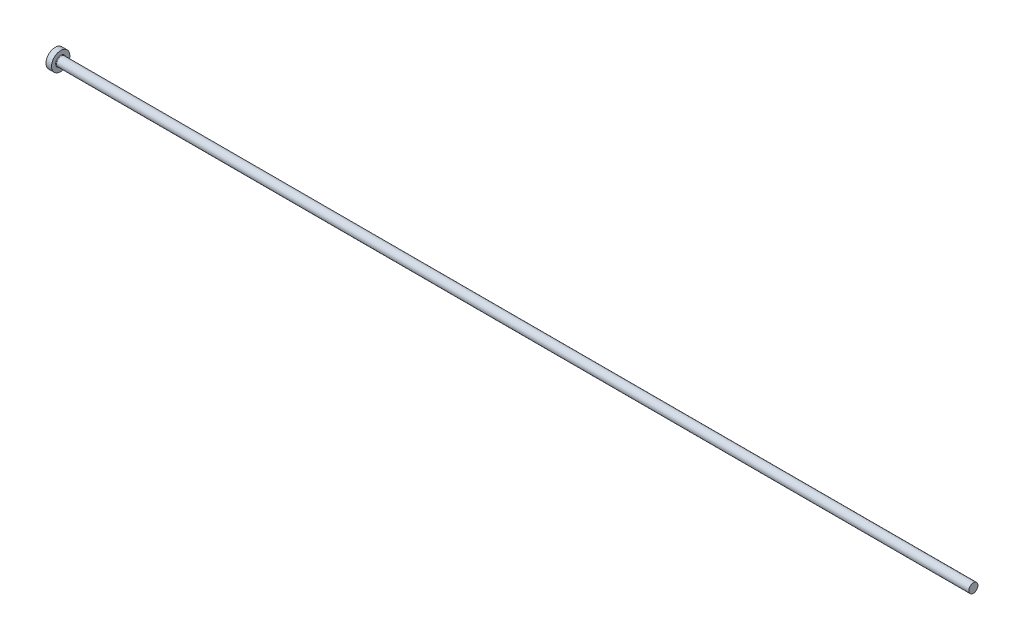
ISO-10303-21;
HEADER;
FILE_DESCRIPTION(('STEP AP214'),'2;1');
FILE_NAME('part.step','',(''),(''),'','','');
FILE_SCHEMA(('AUTOMOTIVE_DESIGN { 1 0 10303 214 1 1 1 1 }'));
ENDSEC;
DATA;
#1=APPLICATION_CONTEXT('core data for automotive mechanical design processes');
#2=APPLICATION_PROTOCOL_DEFINITION('international standard','automotive_design',2000,#1);
#3=PRODUCT_CONTEXT('',#1,'mechanical');
#4=PRODUCT('Part','Part','',(#3));
#5=PRODUCT_RELATED_PRODUCT_CATEGORY('part','',(#4));
#6=PRODUCT_DEFINITION_FORMATION('','',#4);
#7=PRODUCT_DEFINITION_CONTEXT('part definition',#1,'design');
#8=PRODUCT_DEFINITION('design','',#6,#7);
#9=PRODUCT_DEFINITION_SHAPE('','',#8);
#10=(LENGTH_UNIT() NAMED_UNIT(*) SI_UNIT(.MILLI.,.METRE.));
#11=(NAMED_UNIT(*) PLANE_ANGLE_UNIT() SI_UNIT($,.RADIAN.));
#12=(NAMED_UNIT(*) SI_UNIT($,.STERADIAN.) SOLID_ANGLE_UNIT());
#13=UNCERTAINTY_MEASURE_WITH_UNIT(LENGTH_MEASURE(1.E-05),#10,'distance_accuracy_value','');
#14=(GEOMETRIC_REPRESENTATION_CONTEXT(3) GLOBAL_UNCERTAINTY_ASSIGNED_CONTEXT((#13)) GLOBAL_UNIT_ASSIGNED_CONTEXT((#10,
#11,#12)) REPRESENTATION_CONTEXT('',''));
#15=CARTESIAN_POINT('',(0.,0.,0.));
#16=DIRECTION('',(0.,0.,1.));
#17=DIRECTION('',(1.,0.,0.));
#18=AXIS2_PLACEMENT_3D('',#15,#16,#17);
#19=CARTESIAN_POINT('',(0.,0.,0.));
#20=DIRECTION('',(-1.,0.,0.));
#21=DIRECTION('',(0.,-1.,0.));
#22=AXIS2_PLACEMENT_3D('',#19,#20,#21);
#23=PLANE('',#22);
#24=CARTESIAN_POINT('',(0.,0.,0.));
#25=DIRECTION('',(1.,0.,0.));
#26=DIRECTION('',(0.,1.,0.));
#27=AXIS2_PLACEMENT_3D('',#24,#25,#26);
#28=CIRCLE('',#27,5.);
#29=CARTESIAN_POINT('',(0.,5.,0.));
#30=VERTEX_POINT('',#29);
#31=EDGE_CURVE('E25',#30,#30,#28,.T.);
#32=ORIENTED_EDGE('',*,*,#31,.F.);
#33=EDGE_LOOP('',(#32));
#34=FACE_BOUND('',#33,.T.);
#35=ADVANCED_FACE('F14',(#34),#23,.T.);
#36=CARTESIAN_POINT('',(500.,0.,0.));
#37=DIRECTION('',(1.,0.,0.));
#38=DIRECTION('',(0.,1.,0.));
#39=AXIS2_PLACEMENT_3D('',#36,#37,#38);
#40=CYLINDRICAL_SURFACE('',#39,5.);
#41=ORIENTED_EDGE('',*,*,#31,.T.);
#42=EDGE_LOOP('',(#41));
#43=FACE_BOUND('',#42,.T.);
#44=CARTESIAN_POINT('',(3.,0.,0.));
#45=DIRECTION('',(1.,0.,0.));
#46=DIRECTION('',(0.,1.,0.));
#47=AXIS2_PLACEMENT_3D('',#44,#45,#46);
#48=CIRCLE('',#47,5.);
#49=CARTESIAN_POINT('',(3.,5.,0.));
#50=VERTEX_POINT('',#49);
#51=EDGE_CURVE('E29',#50,#50,#48,.T.);
#52=ORIENTED_EDGE('',*,*,#51,.F.);
#53=EDGE_LOOP('',(#52));
#54=FACE_BOUND('',#53,.T.);
#55=ADVANCED_FACE('F51',(#43,#54),#40,.T.);
#56=CARTESIAN_POINT('',(3.,5.,0.));
#57=DIRECTION('',(1.,0.,0.));
#58=DIRECTION('',(0.,1.,0.));
#59=AXIS2_PLACEMENT_3D('',#56,#57,#58);
#60=PLANE('',#59);
#61=CARTESIAN_POINT('',(3.,0.,0.));
#62=DIRECTION('',(1.,0.,0.));
#63=DIRECTION('',(0.,1.,0.));
#64=AXIS2_PLACEMENT_3D('',#61,#62,#63);
#65=CIRCLE('',#64,2.79999999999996);
#66=CARTESIAN_POINT('',(3.,2.79999999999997,0.));
#67=VERTEX_POINT('',#66);
#68=EDGE_CURVE('E9',#67,#67,#65,.F.);
#69=ORIENTED_EDGE('',*,*,#68,.T.);
#70=EDGE_LOOP('',(#69));
#71=FACE_BOUND('',#70,.T.);
#72=ORIENTED_EDGE('',*,*,#51,.T.);
#73=EDGE_LOOP('',(#72));
#74=FACE_BOUND('',#73,.T.);
#75=ADVANCED_FACE('F42',(#71,#74),#60,.T.);
#76=CARTESIAN_POINT('',(500.,0.,0.));
#77=DIRECTION('',(1.,0.,0.));
#78=DIRECTION('',(0.,1.,0.));
#79=AXIS2_PLACEMENT_3D('',#76,#77,#78);
#80=CYLINDRICAL_SURFACE('',#79,2.49999999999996);
#81=CARTESIAN_POINT('',(3.3,0.,0.));
#82=DIRECTION('',(1.,0.,0.));
#83=DIRECTION('',(0.,1.,0.));
#84=AXIS2_PLACEMENT_3D('',#81,#82,#83);
#85=CIRCLE('',#84,2.49999999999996);
#86=CARTESIAN_POINT('',(3.3,2.49999999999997,0.));
#87=VERTEX_POINT('',#86);
#88=EDGE_CURVE('E21',#87,#87,#85,.T.);
#89=ORIENTED_EDGE('',*,*,#88,.T.);
#90=EDGE_LOOP('',(#89));
#91=FACE_BOUND('',#90,.T.);
#92=CARTESIAN_POINT('',(500.,0.,0.));
#93=DIRECTION('',(1.,0.,0.));
#94=DIRECTION('',(0.,1.,0.));
#95=AXIS2_PLACEMENT_3D('',#92,#93,#94);
#96=CIRCLE('',#95,2.49999999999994);
#97=CARTESIAN_POINT('',(500.,2.49999999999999,0.));
#98=VERTEX_POINT('',#97);
#99=EDGE_CURVE('E34',#98,#98,#96,.T.);
#100=ORIENTED_EDGE('',*,*,#99,.F.);
#101=EDGE_LOOP('',(#100));
#102=FACE_BOUND('',#101,.T.);
#103=ADVANCED_FACE('F40',(#91,#102),#80,.T.);
#104=CARTESIAN_POINT('',(500.,2.5,0.));
#105=DIRECTION('',(1.,0.,0.));
#106=DIRECTION('',(0.,1.,0.));
#107=AXIS2_PLACEMENT_3D('',#104,#105,#106);
#108=PLANE('',#107);
#109=ORIENTED_EDGE('',*,*,#99,.T.);
#110=EDGE_LOOP('',(#109));
#111=FACE_BOUND('',#110,.T.);
#112=ADVANCED_FACE('F38',(#111),#108,.T.);
#113=CARTESIAN_POINT('',(3.3,0.,0.));
#114=DIRECTION('',(1.,0.,0.));
#115=DIRECTION('',(0.,1.,0.));
#116=AXIS2_PLACEMENT_3D('',#113,#114,#115);
#117=TOROIDAL_SURFACE('',#116,2.79999999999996,0.3);
#118=ORIENTED_EDGE('',*,*,#68,.F.);
#119=EDGE_LOOP('',(#118));
#120=FACE_BOUND('',#119,.T.);
#121=ORIENTED_EDGE('',*,*,#88,.F.);
#122=EDGE_LOOP('',(#121));
#123=FACE_BOUND('',#122,.T.);
#124=ADVANCED_FACE('F16',(#120,#123),#117,.F.);
#125=CLOSED_SHELL('',(#35,#55,#75,#103,#112,#124));
#126=MANIFOLD_SOLID_BREP('B1',#125);
#127=ADVANCED_BREP_SHAPE_REPRESENTATION('',(#18,#126),#14);
#128=SHAPE_DEFINITION_REPRESENTATION(#9,#127);
ENDSEC;
END-ISO-10303-21;
